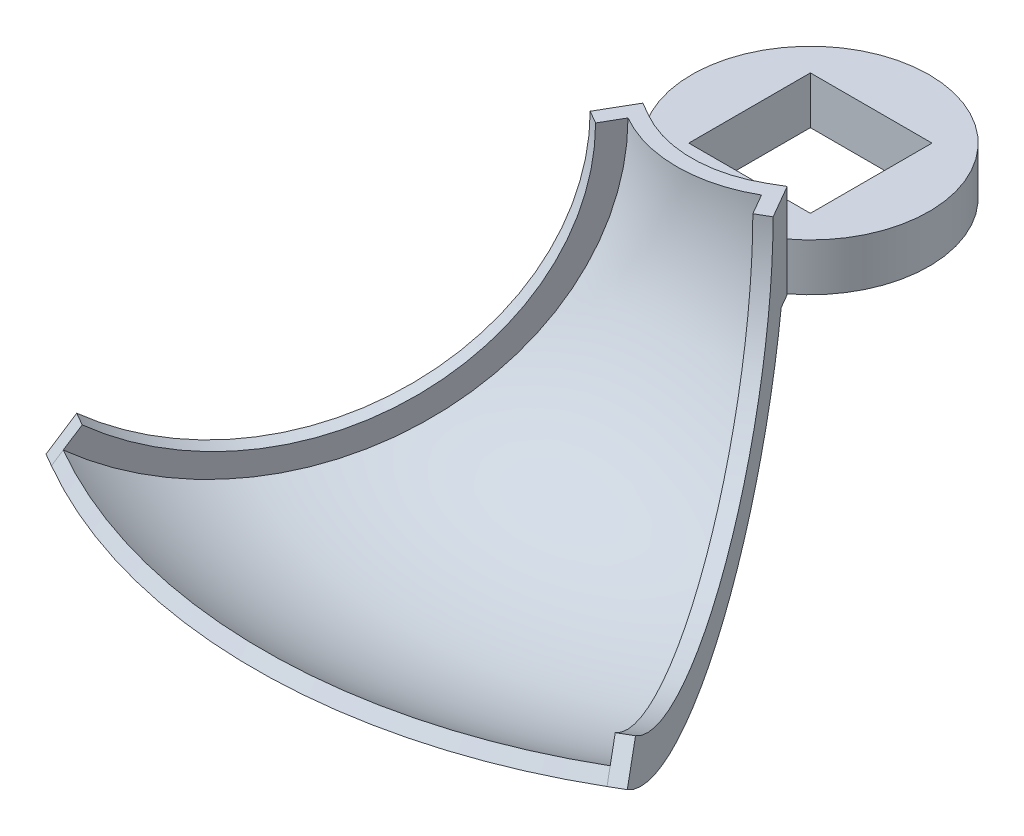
ISO-10303-21;
HEADER;
FILE_DESCRIPTION(('STEP AP214'),'2;1');
FILE_NAME('part.step','',(''),(''),'','','');
FILE_SCHEMA(('AUTOMOTIVE_DESIGN { 1 0 10303 214 1 1 1 1 }'));
ENDSEC;
DATA;
#1=APPLICATION_CONTEXT('core data for automotive mechanical design processes');
#2=APPLICATION_PROTOCOL_DEFINITION('international standard','automotive_design',2000,#1);
#3=PRODUCT_CONTEXT('',#1,'mechanical');
#4=PRODUCT('Part','Part','',(#3));
#5=PRODUCT_RELATED_PRODUCT_CATEGORY('part','',(#4));
#6=PRODUCT_DEFINITION_FORMATION('','',#4);
#7=PRODUCT_DEFINITION_CONTEXT('part definition',#1,'design');
#8=PRODUCT_DEFINITION('design','',#6,#7);
#9=PRODUCT_DEFINITION_SHAPE('','',#8);
#10=(LENGTH_UNIT() NAMED_UNIT(*) SI_UNIT(.MILLI.,.METRE.));
#11=(NAMED_UNIT(*) PLANE_ANGLE_UNIT() SI_UNIT($,.RADIAN.));
#12=(NAMED_UNIT(*) SI_UNIT($,.STERADIAN.) SOLID_ANGLE_UNIT());
#13=UNCERTAINTY_MEASURE_WITH_UNIT(LENGTH_MEASURE(1.E-05),#10,'distance_accuracy_value','');
#14=(GEOMETRIC_REPRESENTATION_CONTEXT(3) GLOBAL_UNCERTAINTY_ASSIGNED_CONTEXT((#13)) GLOBAL_UNIT_ASSIGNED_CONTEXT((#10,
#11,#12)) REPRESENTATION_CONTEXT('',''));
#15=CARTESIAN_POINT('',(0.,0.,0.));
#16=DIRECTION('',(0.,0.,1.));
#17=DIRECTION('',(1.,0.,0.));
#18=AXIS2_PLACEMENT_3D('',#15,#16,#17);
#19=CARTESIAN_POINT('',(0.,16.,0.));
#20=DIRECTION('',(0.,-1.,0.));
#21=DIRECTION('',(0.,0.,-1.));
#22=AXIS2_PLACEMENT_3D('',#19,#20,#21);
#23=CYLINDRICAL_SURFACE('',#22,40.);
#24=DIRECTION('',(0.,-1.,0.));
#25=VECTOR('',#24,1.);
#26=CARTESIAN_POINT('',(20.,0.,34.6410161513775));
#27=LINE('',#26,#25);
#28=CARTESIAN_POINT('',(20.,16.,34.6410161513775));
#29=VERTEX_POINT('',#28);
#30=CARTESIAN_POINT('',(20.,0.,34.6410161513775));
#31=VERTEX_POINT('',#30);
#32=EDGE_CURVE('E236',#29,#31,#27,.T.);
#33=ORIENTED_EDGE('',*,*,#32,.T.);
#34=CARTESIAN_POINT('',(0.,0.,0.));
#35=DIRECTION('',(0.,1.,0.));
#36=DIRECTION('',(0.,0.,1.));
#37=AXIS2_PLACEMENT_3D('',#34,#35,#36);
#38=CIRCLE('',#37,40.);
#39=CARTESIAN_POINT('',(-20.,0.,34.6410161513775));
#40=VERTEX_POINT('',#39);
#41=EDGE_CURVE('E40',#31,#40,#38,.T.);
#42=ORIENTED_EDGE('',*,*,#41,.T.);
#43=DIRECTION('',(0.,-1.,0.));
#44=VECTOR('',#43,1.);
#45=CARTESIAN_POINT('',(-20.,0.,34.6410161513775));
#46=LINE('',#45,#44);
#47=CARTESIAN_POINT('',(-20.,16.,34.6410161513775));
#48=VERTEX_POINT('',#47);
#49=EDGE_CURVE('E277',#48,#40,#46,.T.);
#50=ORIENTED_EDGE('',*,*,#49,.F.);
#51=CARTESIAN_POINT('',(0.,16.,0.));
#52=DIRECTION('',(0.,1.,0.));
#53=DIRECTION('',(0.,0.,1.));
#54=AXIS2_PLACEMENT_3D('',#51,#52,#53);
#55=CIRCLE('',#54,40.);
#56=EDGE_CURVE('E11',#29,#48,#55,.T.);
#57=ORIENTED_EDGE('',*,*,#56,.F.);
#58=EDGE_LOOP('',(#33,#42,#50,#57));
#59=FACE_BOUND('',#58,.T.);
#60=ADVANCED_FACE('F32',(#59),#23,.T.);
#61=CARTESIAN_POINT('',(0.,16.,0.));
#62=DIRECTION('',(0.,1.,0.));
#63=DIRECTION('',(0.,0.,1.));
#64=AXIS2_PLACEMENT_3D('',#61,#62,#63);
#65=PLANE('',#64);
#66=DIRECTION('',(0.,0.,-1.));
#67=VECTOR('',#66,1.);
#68=CARTESIAN_POINT('',(20.5,16.,20.5));
#69=LINE('',#68,#67);
#70=CARTESIAN_POINT('',(20.5,16.,20.5));
#71=VERTEX_POINT('',#70);
#72=CARTESIAN_POINT('',(20.5,16.,-20.5));
#73=VERTEX_POINT('',#72);
#74=EDGE_CURVE('E48',#71,#73,#69,.T.);
#75=ORIENTED_EDGE('',*,*,#74,.F.);
#76=DIRECTION('',(1.,0.,0.));
#77=VECTOR('',#76,1.);
#78=CARTESIAN_POINT('',(20.5,16.,20.5));
#79=LINE('',#78,#77);
#80=CARTESIAN_POINT('',(-20.5,16.,20.5));
#81=VERTEX_POINT('',#80);
#82=EDGE_CURVE('E267',#81,#71,#79,.T.);
#83=ORIENTED_EDGE('',*,*,#82,.F.);
#84=DIRECTION('',(0.,0.,1.));
#85=VECTOR('',#84,1.);
#86=CARTESIAN_POINT('',(-20.5,16.,20.5));
#87=LINE('',#86,#85);
#88=CARTESIAN_POINT('',(-20.5,16.,-20.5));
#89=VERTEX_POINT('',#88);
#90=EDGE_CURVE('E280',#89,#81,#87,.T.);
#91=ORIENTED_EDGE('',*,*,#90,.F.);
#92=DIRECTION('',(-1.,0.,0.));
#93=VECTOR('',#92,1.);
#94=CARTESIAN_POINT('',(20.5,16.,-20.5));
#95=LINE('',#94,#93);
#96=EDGE_CURVE('E276',#73,#89,#95,.T.);
#97=ORIENTED_EDGE('',*,*,#96,.F.);
#98=EDGE_LOOP('',(#75,#83,#91,#97));
#99=FACE_BOUND('',#98,.T.);
#100=ORIENTED_EDGE('',*,*,#56,.T.);
#101=CARTESIAN_POINT('',(0.,16.,0.));
#102=DIRECTION('',(0.,-1.,0.));
#103=DIRECTION('',(0.500000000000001,0.,0.866025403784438));
#104=AXIS2_PLACEMENT_3D('',#101,#102,#103);
#105=CIRCLE('',#104,40.);
#106=EDGE_CURVE('E242',#29,#48,#105,.T.);
#107=ORIENTED_EDGE('',*,*,#106,.F.);
#108=EDGE_LOOP('',(#100,#107));
#109=FACE_BOUND('',#108,.T.);
#110=ADVANCED_FACE('F397',(#99,#109),#65,.T.);
#111=CARTESIAN_POINT('',(0.,0.,0.));
#112=DIRECTION('',(0.,1.,0.));
#113=DIRECTION('',(0.,0.,1.));
#114=AXIS2_PLACEMENT_3D('',#111,#112,#113);
#115=PLANE('',#114);
#116=DIRECTION('',(1.,0.,0.));
#117=VECTOR('',#116,1.);
#118=CARTESIAN_POINT('',(20.5,0.,20.5));
#119=LINE('',#118,#117);
#120=CARTESIAN_POINT('',(-20.5,0.,20.5));
#121=VERTEX_POINT('',#120);
#122=CARTESIAN_POINT('',(20.5,0.,20.5));
#123=VERTEX_POINT('',#122);
#124=EDGE_CURVE('E271',#121,#123,#119,.T.);
#125=ORIENTED_EDGE('',*,*,#124,.T.);
#126=DIRECTION('',(0.,0.,-1.));
#127=VECTOR('',#126,1.);
#128=CARTESIAN_POINT('',(20.5,0.,20.5));
#129=LINE('',#128,#127);
#130=CARTESIAN_POINT('',(20.5,0.,-20.5));
#131=VERTEX_POINT('',#130);
#132=EDGE_CURVE('E263',#123,#131,#129,.T.);
#133=ORIENTED_EDGE('',*,*,#132,.T.);
#134=DIRECTION('',(-1.,0.,0.));
#135=VECTOR('',#134,1.);
#136=CARTESIAN_POINT('',(20.5,0.,-20.5));
#137=LINE('',#136,#135);
#138=CARTESIAN_POINT('',(-20.5,0.,-20.5));
#139=VERTEX_POINT('',#138);
#140=EDGE_CURVE('E266',#131,#139,#137,.T.);
#141=ORIENTED_EDGE('',*,*,#140,.T.);
#142=DIRECTION('',(0.,0.,1.));
#143=VECTOR('',#142,1.);
#144=CARTESIAN_POINT('',(-20.5,0.,20.5));
#145=LINE('',#144,#143);
#146=EDGE_CURVE('E56',#139,#121,#145,.T.);
#147=ORIENTED_EDGE('',*,*,#146,.T.);
#148=EDGE_LOOP('',(#125,#133,#141,#147));
#149=FACE_BOUND('',#148,.T.);
#150=ORIENTED_EDGE('',*,*,#41,.F.);
#151=DIRECTION('',(-0.866025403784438,0.,0.500000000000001));
#152=VECTOR('',#151,1.);
#153=CARTESIAN_POINT('',(24.3301270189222,0.,32.1410161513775));
#154=LINE('',#153,#152);
#155=CARTESIAN_POINT('',(24.3301270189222,0.,32.1410161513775));
#156=VERTEX_POINT('',#155);
#157=EDGE_CURVE('E211',#156,#31,#154,.T.);
#158=ORIENTED_EDGE('',*,*,#157,.F.);
#159=DIRECTION('',(-0.500000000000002,0.,-0.866025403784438));
#160=VECTOR('',#159,1.);
#161=CARTESIAN_POINT('',(27.0940017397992,0.,36.9281875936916));
#162=LINE('',#161,#160);
#163=CARTESIAN_POINT('',(27.0940017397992,0.,36.9281875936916));
#164=VERTEX_POINT('',#163);
#165=EDGE_CURVE('E210',#164,#156,#162,.T.);
#166=ORIENTED_EDGE('',*,*,#165,.F.);
#167=DIRECTION('',(-0.866025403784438,0.,0.500000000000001));
#168=VECTOR('',#167,1.);
#169=CARTESIAN_POINT('',(27.0940017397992,0.,36.9281875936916));
#170=LINE('',#169,#168);
#171=CARTESIAN_POINT('',(22.763874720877,0.,39.4281875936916));
#172=VERTEX_POINT('',#171);
#173=EDGE_CURVE('E217',#164,#172,#170,.T.);
#174=ORIENTED_EDGE('',*,*,#173,.T.);
#175=CARTESIAN_POINT('',(0.,0.,0.));
#176=DIRECTION('',(0.,-1.,0.));
#177=DIRECTION('',(0.500000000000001,0.,0.866025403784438));
#178=AXIS2_PLACEMENT_3D('',#175,#176,#177);
#179=CIRCLE('',#178,45.5277494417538);
#180=CARTESIAN_POINT('',(-22.763874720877,0.,39.4281875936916));
#181=VERTEX_POINT('',#180);
#182=EDGE_CURVE('E232',#172,#181,#179,.T.);
#183=ORIENTED_EDGE('',*,*,#182,.T.);
#184=DIRECTION('',(0.866025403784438,0.,0.500000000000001));
#185=VECTOR('',#184,1.);
#186=CARTESIAN_POINT('',(-27.0940017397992,0.,36.9281875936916));
#187=LINE('',#186,#185);
#188=CARTESIAN_POINT('',(-27.0940017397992,0.,36.9281875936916));
#189=VERTEX_POINT('',#188);
#190=EDGE_CURVE('E195',#189,#181,#187,.T.);
#191=ORIENTED_EDGE('',*,*,#190,.F.);
#192=DIRECTION('',(-0.500000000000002,0.,0.866025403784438));
#193=VECTOR('',#192,1.);
#194=CARTESIAN_POINT('',(-24.3301270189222,0.,32.1410161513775));
#195=LINE('',#194,#193);
#196=CARTESIAN_POINT('',(-24.3301270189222,0.,32.1410161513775));
#197=VERTEX_POINT('',#196);
#198=EDGE_CURVE('E174',#197,#189,#195,.T.);
#199=ORIENTED_EDGE('',*,*,#198,.F.);
#200=DIRECTION('',(0.866025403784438,0.,0.500000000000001));
#201=VECTOR('',#200,1.);
#202=CARTESIAN_POINT('',(-24.3301270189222,0.,32.1410161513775));
#203=LINE('',#202,#201);
#204=EDGE_CURVE('E171',#197,#40,#203,.T.);
#205=ORIENTED_EDGE('',*,*,#204,.T.);
#206=EDGE_LOOP('',(#150,#158,#166,#174,#183,#191,#199,#205));
#207=FACE_BOUND('',#206,.T.);
#208=ADVANCED_FACE('F328',(#149,#207),#115,.F.);
#209=CARTESIAN_POINT('',(20.5,0.,20.5));
#210=DIRECTION('',(1.,0.,0.));
#211=DIRECTION('',(0.,0.,-1.));
#212=AXIS2_PLACEMENT_3D('',#209,#210,#211);
#213=PLANE('',#212);
#214=ORIENTED_EDGE('',*,*,#74,.T.);
#215=DIRECTION('',(0.,1.,0.));
#216=VECTOR('',#215,1.);
#217=CARTESIAN_POINT('',(20.5,0.,-20.5));
#218=LINE('',#217,#216);
#219=EDGE_CURVE('E274',#131,#73,#218,.T.);
#220=ORIENTED_EDGE('',*,*,#219,.F.);
#221=ORIENTED_EDGE('',*,*,#132,.F.);
#222=DIRECTION('',(0.,1.,0.));
#223=VECTOR('',#222,1.);
#224=CARTESIAN_POINT('',(20.5,0.,20.5));
#225=LINE('',#224,#223);
#226=EDGE_CURVE('E285',#123,#71,#225,.T.);
#227=ORIENTED_EDGE('',*,*,#226,.T.);
#228=EDGE_LOOP('',(#214,#220,#221,#227));
#229=FACE_BOUND('',#228,.T.);
#230=ADVANCED_FACE('F405',(#229),#213,.F.);
#231=CARTESIAN_POINT('',(20.5,0.,20.5));
#232=DIRECTION('',(0.,0.,1.));
#233=DIRECTION('',(1.,0.,0.));
#234=AXIS2_PLACEMENT_3D('',#231,#232,#233);
#235=PLANE('',#234);
#236=ORIENTED_EDGE('',*,*,#82,.T.);
#237=ORIENTED_EDGE('',*,*,#226,.F.);
#238=ORIENTED_EDGE('',*,*,#124,.F.);
#239=DIRECTION('',(0.,1.,0.));
#240=VECTOR('',#239,1.);
#241=CARTESIAN_POINT('',(-20.5,0.,20.5));
#242=LINE('',#241,#240);
#243=EDGE_CURVE('E287',#121,#81,#242,.T.);
#244=ORIENTED_EDGE('',*,*,#243,.T.);
#245=EDGE_LOOP('',(#236,#237,#238,#244));
#246=FACE_BOUND('',#245,.T.);
#247=ADVANCED_FACE('F410',(#246),#235,.F.);
#248=CARTESIAN_POINT('',(-20.5,0.,20.5));
#249=DIRECTION('',(-1.,0.,0.));
#250=DIRECTION('',(0.,0.,1.));
#251=AXIS2_PLACEMENT_3D('',#248,#249,#250);
#252=PLANE('',#251);
#253=ORIENTED_EDGE('',*,*,#90,.T.);
#254=ORIENTED_EDGE('',*,*,#243,.F.);
#255=ORIENTED_EDGE('',*,*,#146,.F.);
#256=DIRECTION('',(0.,1.,0.));
#257=VECTOR('',#256,1.);
#258=CARTESIAN_POINT('',(-20.5,0.,-20.5));
#259=LINE('',#258,#257);
#260=EDGE_CURVE('E289',#139,#89,#259,.T.);
#261=ORIENTED_EDGE('',*,*,#260,.T.);
#262=EDGE_LOOP('',(#253,#254,#255,#261));
#263=FACE_BOUND('',#262,.T.);
#264=ADVANCED_FACE('F415',(#263),#252,.F.);
#265=CARTESIAN_POINT('',(20.5,0.,-20.5));
#266=DIRECTION('',(0.,0.,-1.));
#267=DIRECTION('',(-1.,0.,0.));
#268=AXIS2_PLACEMENT_3D('',#265,#266,#267);
#269=PLANE('',#268);
#270=ORIENTED_EDGE('',*,*,#96,.T.);
#271=ORIENTED_EDGE('',*,*,#260,.F.);
#272=ORIENTED_EDGE('',*,*,#140,.F.);
#273=ORIENTED_EDGE('',*,*,#219,.T.);
#274=EDGE_LOOP('',(#270,#271,#272,#273));
#275=FACE_BOUND('',#274,.T.);
#276=ADVANCED_FACE('F411',(#275),#269,.F.);
#277=CARTESIAN_POINT('',(0.,31.5848916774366,0.));
#278=DIRECTION('',(0.,-1.,0.));
#279=DIRECTION('',(0.,0.,-1.));
#280=AXIS2_PLACEMENT_3D('',#277,#278,#279);
#281=TOROIDAL_SURFACE('',#280,133.,93.);
#282=CARTESIAN_POINT('',(0.,-43.926448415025,0.));
#283=DIRECTION('',(0.,-1.,0.));
#284=DIRECTION('',(0.500000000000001,0.,0.866025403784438));
#285=AXIS2_PLACEMENT_3D('',#282,#283,#284);
#286=CIRCLE('',#285,187.286623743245);
#287=CARTESIAN_POINT('',(93.6433118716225,-43.926448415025,162.194973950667));
#288=VERTEX_POINT('',#287);
#289=CARTESIAN_POINT('',(-93.6433118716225,-43.926448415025,162.194973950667));
#290=VERTEX_POINT('',#289);
#291=EDGE_CURVE('E235',#288,#290,#286,.T.);
#292=ORIENTED_EDGE('',*,*,#291,.T.);
#293=CARTESIAN_POINT('',(-66.5000000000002,31.5848916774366,115.18137870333));
#294=DIRECTION('',(-0.866025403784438,0.,-0.500000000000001));
#295=DIRECTION('',(-0.500000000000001,0.,0.866025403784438));
#296=AXIS2_PLACEMENT_3D('',#293,#294,#295);
#297=CIRCLE('',#296,93.);
#298=EDGE_CURVE('E239',#181,#290,#297,.T.);
#299=ORIENTED_EDGE('',*,*,#298,.F.);
#300=ORIENTED_EDGE('',*,*,#182,.F.);
#301=CARTESIAN_POINT('',(66.5000000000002,31.5848916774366,115.18137870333));
#302=DIRECTION('',(-0.866025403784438,0.,0.500000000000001));
#303=DIRECTION('',(0.500000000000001,0.,0.866025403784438));
#304=AXIS2_PLACEMENT_3D('',#301,#302,#303);
#305=CIRCLE('',#304,93.);
#306=EDGE_CURVE('E231',#172,#288,#305,.T.);
#307=ORIENTED_EDGE('',*,*,#306,.T.);
#308=EDGE_LOOP('',(#292,#299,#300,#307));
#309=FACE_BOUND('',#308,.T.);
#310=ADVANCED_FACE('F414',(#309),#281,.T.);
#311=CARTESIAN_POINT('',(0.,-43.926448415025,0.));
#312=DIRECTION('',(0.,-1.,0.));
#313=DIRECTION('',(0.,0.,-1.));
#314=AXIS2_PLACEMENT_3D('',#311,#312,#313);
#315=CONICAL_SURFACE('',#314,187.286623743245,0.623311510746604);
#316=CARTESIAN_POINT('',(0.,-39.8666989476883,0.));
#317=DIRECTION('',(0.,-1.,0.));
#318=DIRECTION('',(0.500000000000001,0.,0.866025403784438));
#319=AXIS2_PLACEMENT_3D('',#316,#317,#318);
#320=CIRCLE('',#319,184.367988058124);
#321=CARTESIAN_POINT('',(92.1839940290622,-39.8666989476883,159.667361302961));
#322=VERTEX_POINT('',#321);
#323=CARTESIAN_POINT('',(-92.1839940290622,-39.8666989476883,159.667361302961));
#324=VERTEX_POINT('',#323);
#325=EDGE_CURVE('E245',#322,#324,#320,.T.);
#326=ORIENTED_EDGE('',*,*,#325,.T.);
#327=DIRECTION('',(0.291863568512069,0.811949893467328,-0.505522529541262));
#328=VECTOR('',#327,1.);
#329=CARTESIAN_POINT('',(-92.1839940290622,-39.8666989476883,159.667361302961));
#330=LINE('',#329,#328);
#331=EDGE_CURVE('E241',#290,#324,#330,.T.);
#332=ORIENTED_EDGE('',*,*,#331,.F.);
#333=ORIENTED_EDGE('',*,*,#291,.F.);
#334=DIRECTION('',(-0.291863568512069,0.811949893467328,-0.505522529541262));
#335=VECTOR('',#334,1.);
#336=CARTESIAN_POINT('',(92.1839940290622,-39.8666989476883,159.667361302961));
#337=LINE('',#336,#335);
#338=EDGE_CURVE('E238',#288,#322,#337,.T.);
#339=ORIENTED_EDGE('',*,*,#338,.T.);
#340=EDGE_LOOP('',(#326,#332,#333,#339));
#341=FACE_BOUND('',#340,.T.);
#342=ADVANCED_FACE('F371',(#341),#315,.T.);
#343=CARTESIAN_POINT('',(0.,31.5848916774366,0.));
#344=DIRECTION('',(0.,-1.,0.));
#345=DIRECTION('',(0.,0.,-1.));
#346=AXIS2_PLACEMENT_3D('',#343,#344,#345);
#347=TOROIDAL_SURFACE('',#346,133.,88.);
#348=CARTESIAN_POINT('',(0.,31.5848916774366,0.));
#349=DIRECTION('',(0.,-1.,0.));
#350=DIRECTION('',(0.500000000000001,0.,0.866025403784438));
#351=AXIS2_PLACEMENT_3D('',#348,#349,#350);
#352=CIRCLE('',#351,45.);
#353=CARTESIAN_POINT('',(22.5000000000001,31.5848916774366,38.9711431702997));
#354=VERTEX_POINT('',#353);
#355=CARTESIAN_POINT('',(-22.5000000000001,31.5848916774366,38.9711431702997));
#356=VERTEX_POINT('',#355);
#357=EDGE_CURVE('E254',#354,#356,#352,.T.);
#358=ORIENTED_EDGE('',*,*,#357,.T.);
#359=CARTESIAN_POINT('',(-66.5000000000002,31.5848916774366,115.18137870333));
#360=DIRECTION('',(0.866025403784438,0.,0.500000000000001));
#361=DIRECTION('',(-0.500000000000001,0.,0.866025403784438));
#362=AXIS2_PLACEMENT_3D('',#359,#360,#361);
#363=CIRCLE('',#362,88.);
#364=EDGE_CURVE('E251',#324,#356,#363,.T.);
#365=ORIENTED_EDGE('',*,*,#364,.F.);
#366=ORIENTED_EDGE('',*,*,#325,.F.);
#367=CARTESIAN_POINT('',(66.5000000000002,31.5848916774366,115.18137870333));
#368=DIRECTION('',(0.866025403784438,0.,-0.500000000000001));
#369=DIRECTION('',(0.500000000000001,0.,0.866025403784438));
#370=AXIS2_PLACEMENT_3D('',#367,#368,#369);
#371=CIRCLE('',#370,88.);
#372=EDGE_CURVE('E248',#322,#354,#371,.T.);
#373=ORIENTED_EDGE('',*,*,#372,.T.);
#374=EDGE_LOOP('',(#358,#365,#366,#373));
#375=FACE_BOUND('',#374,.T.);
#376=ADVANCED_FACE('F369',(#375),#347,.F.);
#377=CARTESIAN_POINT('',(20.,31.5848916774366,34.6410161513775));
#378=DIRECTION('',(0.,1.,0.));
#379=DIRECTION('',(0.,0.,1.));
#380=AXIS2_PLACEMENT_3D('',#377,#378,#379);
#381=PLANE('',#380);
#382=CARTESIAN_POINT('',(0.,31.5848916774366,0.));
#383=DIRECTION('',(0.,-1.,0.));
#384=DIRECTION('',(0.500000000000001,0.,0.866025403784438));
#385=AXIS2_PLACEMENT_3D('',#382,#383,#384);
#386=CIRCLE('',#385,40.);
#387=CARTESIAN_POINT('',(20.,31.5848916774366,34.6410161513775));
#388=VERTEX_POINT('',#387);
#389=CARTESIAN_POINT('',(-20.,31.5848916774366,34.6410161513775));
#390=VERTEX_POINT('',#389);
#391=EDGE_CURVE('E190',#388,#390,#386,.T.);
#392=ORIENTED_EDGE('',*,*,#391,.T.);
#393=DIRECTION('',(0.866025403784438,0.,0.500000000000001));
#394=VECTOR('',#393,1.);
#395=CARTESIAN_POINT('',(-24.3301270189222,31.5848916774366,32.1410161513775));
#396=LINE('',#395,#394);
#397=CARTESIAN_POINT('',(-24.3301270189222,31.5848916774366,32.1410161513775));
#398=VERTEX_POINT('',#397);
#399=EDGE_CURVE('E168',#398,#390,#396,.T.);
#400=ORIENTED_EDGE('',*,*,#399,.F.);
#401=DIRECTION('',(0.500000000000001,0.,-0.866025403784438));
#402=VECTOR('',#401,1.);
#403=CARTESIAN_POINT('',(-26.8301270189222,31.5848916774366,36.4711431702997));
#404=LINE('',#403,#402);
#405=CARTESIAN_POINT('',(-30.8301270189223,31.5848916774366,43.3993464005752));
#406=VERTEX_POINT('',#405);
#407=EDGE_CURVE('E175',#406,#398,#404,.T.);
#408=ORIENTED_EDGE('',*,*,#407,.F.);
#409=DIRECTION('',(0.866025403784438,0.,0.500000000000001));
#410=VECTOR('',#409,1.);
#411=CARTESIAN_POINT('',(-30.8301270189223,31.5848916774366,43.3993464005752));
#412=LINE('',#411,#410);
#413=CARTESIAN_POINT('',(-26.5000000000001,31.5848916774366,45.8993464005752));
#414=VERTEX_POINT('',#413);
#415=EDGE_CURVE('E339',#406,#414,#412,.T.);
#416=ORIENTED_EDGE('',*,*,#415,.T.);
#417=DIRECTION('',(0.500000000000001,0.,-0.866025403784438));
#418=VECTOR('',#417,1.);
#419=CARTESIAN_POINT('',(-22.5,31.5848916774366,38.9711431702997));
#420=LINE('',#419,#418);
#421=EDGE_CURVE('E184',#414,#356,#420,.T.);
#422=ORIENTED_EDGE('',*,*,#421,.T.);
#423=ORIENTED_EDGE('',*,*,#357,.F.);
#424=DIRECTION('',(0.500000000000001,0.,0.866025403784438));
#425=VECTOR('',#424,1.);
#426=CARTESIAN_POINT('',(22.5000000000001,31.5848916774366,38.9711431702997));
#427=LINE('',#426,#425);
#428=CARTESIAN_POINT('',(26.5000000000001,31.5848916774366,45.8993464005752));
#429=VERTEX_POINT('',#428);
#430=EDGE_CURVE('E191',#354,#429,#427,.T.);
#431=ORIENTED_EDGE('',*,*,#430,.T.);
#432=DIRECTION('',(-0.866025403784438,0.,0.500000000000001));
#433=VECTOR('',#432,1.);
#434=CARTESIAN_POINT('',(30.8301270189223,31.5848916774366,43.3993464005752));
#435=LINE('',#434,#433);
#436=CARTESIAN_POINT('',(30.8301270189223,31.5848916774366,43.3993464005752));
#437=VERTEX_POINT('',#436);
#438=EDGE_CURVE('E226',#437,#429,#435,.T.);
#439=ORIENTED_EDGE('',*,*,#438,.F.);
#440=DIRECTION('',(0.500000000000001,0.,0.866025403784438));
#441=VECTOR('',#440,1.);
#442=CARTESIAN_POINT('',(24.3301270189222,31.5848916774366,32.1410161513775));
#443=LINE('',#442,#441);
#444=CARTESIAN_POINT('',(24.3301270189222,31.5848916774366,32.1410161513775));
#445=VERTEX_POINT('',#444);
#446=EDGE_CURVE('E201',#445,#437,#443,.T.);
#447=ORIENTED_EDGE('',*,*,#446,.F.);
#448=DIRECTION('',(-0.866025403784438,0.,0.500000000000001));
#449=VECTOR('',#448,1.);
#450=CARTESIAN_POINT('',(24.3301270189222,31.5848916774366,32.1410161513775));
#451=LINE('',#450,#449);
#452=EDGE_CURVE('E229',#445,#388,#451,.T.);
#453=ORIENTED_EDGE('',*,*,#452,.T.);
#454=EDGE_LOOP('',(#392,#400,#408,#416,#422,#423,#431,#439,#447,#453));
#455=FACE_BOUND('',#454,.T.);
#456=ADVANCED_FACE('F187',(#455),#381,.T.);
#457=CARTESIAN_POINT('',(0.,16.,0.));
#458=DIRECTION('',(0.,-1.,0.));
#459=DIRECTION('',(0.,0.,-1.));
#460=AXIS2_PLACEMENT_3D('',#457,#458,#459);
#461=CYLINDRICAL_SURFACE('',#460,40.);
#462=ORIENTED_EDGE('',*,*,#106,.T.);
#463=DIRECTION('',(0.,-1.,0.));
#464=VECTOR('',#463,1.);
#465=CARTESIAN_POINT('',(-20.,16.,34.6410161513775));
#466=LINE('',#465,#464);
#467=EDGE_CURVE('E260',#390,#48,#466,.T.);
#468=ORIENTED_EDGE('',*,*,#467,.F.);
#469=ORIENTED_EDGE('',*,*,#391,.F.);
#470=DIRECTION('',(0.,-1.,0.));
#471=VECTOR('',#470,1.);
#472=CARTESIAN_POINT('',(20.,16.,34.6410161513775));
#473=LINE('',#472,#471);
#474=EDGE_CURVE('E257',#388,#29,#473,.T.);
#475=ORIENTED_EDGE('',*,*,#474,.T.);
#476=EDGE_LOOP('',(#462,#468,#469,#475));
#477=FACE_BOUND('',#476,.T.);
#478=ADVANCED_FACE('F395',(#477),#461,.F.);
#479=CARTESIAN_POINT('',(24.3301270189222,16.,32.1410161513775));
#480=DIRECTION('',(0.500000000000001,0.,0.866025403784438));
#481=DIRECTION('',(0.866025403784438,0.,-0.500000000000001));
#482=AXIS2_PLACEMENT_3D('',#479,#480,#481);
#483=PLANE('',#482);
#484=ORIENTED_EDGE('',*,*,#32,.F.);
#485=ORIENTED_EDGE('',*,*,#474,.F.);
#486=ORIENTED_EDGE('',*,*,#452,.F.);
#487=DIRECTION('',(0.,1.,0.));
#488=VECTOR('',#487,1.);
#489=CARTESIAN_POINT('',(24.3301270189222,0.,32.1410161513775));
#490=LINE('',#489,#488);
#491=EDGE_CURVE('E199',#156,#445,#490,.T.);
#492=ORIENTED_EDGE('',*,*,#491,.F.);
#493=ORIENTED_EDGE('',*,*,#157,.T.);
#494=EDGE_LOOP('',(#484,#485,#486,#492,#493));
#495=FACE_BOUND('',#494,.T.);
#496=ADVANCED_FACE('F320',(#495),#483,.F.);
#497=CARTESIAN_POINT('',(70.8301270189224,31.5848916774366,112.68137870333));
#498=DIRECTION('',(-0.866025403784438,0.,0.500000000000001));
#499=DIRECTION('',(0.500000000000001,0.,0.866025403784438));
#500=AXIS2_PLACEMENT_3D('',#497,#498,#499);
#501=CYLINDRICAL_SURFACE('',#500,80.);
#502=CARTESIAN_POINT('',(66.5000000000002,31.5848916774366,115.18137870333));
#503=DIRECTION('',(-0.866025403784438,0.,0.500000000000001));
#504=DIRECTION('',(-0.500000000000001,0.,-0.866025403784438));
#505=AXIS2_PLACEMENT_3D('',#502,#503,#504);
#506=CIRCLE('',#505,80.);
#507=CARTESIAN_POINT('',(89.8490854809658,-33.3710997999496,155.623181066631));
#508=VERTEX_POINT('',#507);
#509=EDGE_CURVE('E193',#429,#508,#506,.T.);
#510=ORIENTED_EDGE('',*,*,#509,.T.);
#511=DIRECTION('',(-0.866025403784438,0.,0.500000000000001));
#512=VECTOR('',#511,1.);
#513=CARTESIAN_POINT('',(94.179212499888,-33.3710997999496,153.123181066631));
#514=LINE('',#513,#512);
#515=CARTESIAN_POINT('',(94.179212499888,-33.3710997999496,153.123181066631));
#516=VERTEX_POINT('',#515);
#517=EDGE_CURVE('E223',#516,#508,#514,.T.);
#518=ORIENTED_EDGE('',*,*,#517,.F.);
#519=CARTESIAN_POINT('',(70.8301270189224,31.5848916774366,112.68137870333));
#520=DIRECTION('',(-0.866025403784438,0.,0.500000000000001));
#521=DIRECTION('',(-0.500000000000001,0.,-0.866025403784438));
#522=AXIS2_PLACEMENT_3D('',#519,#520,#521);
#523=CIRCLE('',#522,80.);
#524=EDGE_CURVE('E204',#437,#516,#523,.T.);
#525=ORIENTED_EDGE('',*,*,#524,.F.);
#526=ORIENTED_EDGE('',*,*,#438,.T.);
#527=EDGE_LOOP('',(#510,#518,#525,#526));
#528=FACE_BOUND('',#527,.T.);
#529=ADVANCED_FACE('F387',(#528),#501,.F.);
#530=CARTESIAN_POINT('',(96.5141210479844,-39.8666989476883,157.167361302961));
#531=DIRECTION('',(-0.405974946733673,-0.583727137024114,-0.703169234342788));
#532=DIRECTION('',(0.,0.769429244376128,-0.6387320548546));
#533=AXIS2_PLACEMENT_3D('',#530,#531,#532);
#534=PLANE('',#533);
#535=DIRECTION('',(0.291863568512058,-0.811949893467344,0.505522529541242));
#536=VECTOR('',#535,1.);
#537=CARTESIAN_POINT('',(92.1839940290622,-39.8666989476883,159.667361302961));
#538=LINE('',#537,#536);
#539=EDGE_CURVE('E202',#508,#322,#538,.T.);
#540=ORIENTED_EDGE('',*,*,#539,.T.);
#541=ORIENTED_EDGE('',*,*,#338,.F.);
#542=DIRECTION('',(-0.866025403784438,0.,0.500000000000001));
#543=VECTOR('',#542,1.);
#544=CARTESIAN_POINT('',(97.9734388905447,-43.926448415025,159.694973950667));
#545=LINE('',#544,#543);
#546=CARTESIAN_POINT('',(97.9734388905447,-43.926448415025,159.694973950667));
#547=VERTEX_POINT('',#546);
#548=EDGE_CURVE('E220',#547,#288,#545,.T.);
#549=ORIENTED_EDGE('',*,*,#548,.F.);
#550=DIRECTION('',(0.291863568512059,-0.811949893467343,0.505522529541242));
#551=VECTOR('',#550,1.);
#552=CARTESIAN_POINT('',(96.5141210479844,-39.8666989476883,157.167361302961));
#553=LINE('',#552,#551);
#554=EDGE_CURVE('E206',#516,#547,#553,.T.);
#555=ORIENTED_EDGE('',*,*,#554,.F.);
#556=ORIENTED_EDGE('',*,*,#517,.T.);
#557=EDGE_LOOP('',(#540,#541,#549,#555,#556));
#558=FACE_BOUND('',#557,.T.);
#559=ADVANCED_FACE('F376',(#558),#534,.F.);
#560=CARTESIAN_POINT('',(70.8301270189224,31.5848916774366,112.68137870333));
#561=DIRECTION('',(-0.866025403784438,0.,0.500000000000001));
#562=DIRECTION('',(0.500000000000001,0.,0.866025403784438));
#563=AXIS2_PLACEMENT_3D('',#560,#561,#562);
#564=CYLINDRICAL_SURFACE('',#563,93.);
#565=ORIENTED_EDGE('',*,*,#548,.T.);
#566=ORIENTED_EDGE('',*,*,#306,.F.);
#567=ORIENTED_EDGE('',*,*,#173,.F.);
#568=CARTESIAN_POINT('',(70.8301270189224,31.5848916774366,112.68137870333));
#569=DIRECTION('',(0.866025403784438,0.,-0.500000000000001));
#570=DIRECTION('',(-0.500000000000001,0.,-0.866025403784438));
#571=AXIS2_PLACEMENT_3D('',#568,#569,#570);
#572=CIRCLE('',#571,93.);
#573=EDGE_CURVE('E208',#547,#164,#572,.T.);
#574=ORIENTED_EDGE('',*,*,#573,.F.);
#575=EDGE_LOOP('',(#565,#566,#567,#574));
#576=FACE_BOUND('',#575,.T.);
#577=ADVANCED_FACE('F380',(#576),#564,.T.);
#578=CARTESIAN_POINT('',(70.8301270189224,31.5848916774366,112.68137870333));
#579=DIRECTION('',(0.866025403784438,0.,-0.500000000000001));
#580=DIRECTION('',(-0.500000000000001,0.,-0.866025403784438));
#581=AXIS2_PLACEMENT_3D('',#578,#579,#580);
#582=PLANE('',#581);
#583=ORIENTED_EDGE('',*,*,#491,.T.);
#584=ORIENTED_EDGE('',*,*,#446,.T.);
#585=ORIENTED_EDGE('',*,*,#524,.T.);
#586=ORIENTED_EDGE('',*,*,#554,.T.);
#587=ORIENTED_EDGE('',*,*,#573,.T.);
#588=ORIENTED_EDGE('',*,*,#165,.T.);
#589=EDGE_LOOP('',(#583,#584,#585,#586,#587,#588));
#590=FACE_BOUND('',#589,.T.);
#591=ADVANCED_FACE('F383',(#590),#582,.T.);
#592=CARTESIAN_POINT('',(66.5000000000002,31.5848916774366,115.18137870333));
#593=DIRECTION('',(0.866025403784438,0.,-0.500000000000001));
#594=DIRECTION('',(-0.500000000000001,0.,-0.866025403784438));
#595=AXIS2_PLACEMENT_3D('',#592,#593,#594);
#596=PLANE('',#595);
#597=ORIENTED_EDGE('',*,*,#372,.F.);
#598=ORIENTED_EDGE('',*,*,#539,.F.);
#599=ORIENTED_EDGE('',*,*,#509,.F.);
#600=ORIENTED_EDGE('',*,*,#430,.F.);
#601=EDGE_LOOP('',(#597,#598,#599,#600));
#602=FACE_BOUND('',#601,.T.);
#603=ADVANCED_FACE('F391',(#602),#596,.F.);
#604=CARTESIAN_POINT('',(-24.3301270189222,16.,32.1410161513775));
#605=DIRECTION('',(-0.500000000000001,0.,0.866025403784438));
#606=DIRECTION('',(0.866025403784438,0.,0.500000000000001));
#607=AXIS2_PLACEMENT_3D('',#604,#605,#606);
#608=PLANE('',#607);
#609=ORIENTED_EDGE('',*,*,#467,.T.);
#610=ORIENTED_EDGE('',*,*,#49,.T.);
#611=ORIENTED_EDGE('',*,*,#204,.F.);
#612=DIRECTION('',(0.,-1.,0.));
#613=VECTOR('',#612,1.);
#614=CARTESIAN_POINT('',(-24.3301270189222,31.5848916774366,32.1410161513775));
#615=LINE('',#614,#613);
#616=EDGE_CURVE('E163',#398,#197,#615,.T.);
#617=ORIENTED_EDGE('',*,*,#616,.F.);
#618=ORIENTED_EDGE('',*,*,#399,.T.);
#619=EDGE_LOOP('',(#609,#610,#611,#617,#618));
#620=FACE_BOUND('',#619,.T.);
#621=ADVANCED_FACE('F166',(#620),#608,.F.);
#622=CARTESIAN_POINT('',(-70.8301270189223,31.5848916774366,112.68137870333));
#623=DIRECTION('',(0.866025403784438,0.,0.500000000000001));
#624=DIRECTION('',(0.500000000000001,0.,-0.866025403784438));
#625=AXIS2_PLACEMENT_3D('',#622,#623,#624);
#626=CYLINDRICAL_SURFACE('',#625,93.);
#627=ORIENTED_EDGE('',*,*,#298,.T.);
#628=DIRECTION('',(0.866025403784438,0.,0.500000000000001));
#629=VECTOR('',#628,1.);
#630=CARTESIAN_POINT('',(-97.9734388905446,-43.9264484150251,159.694973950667));
#631=LINE('',#630,#629);
#632=CARTESIAN_POINT('',(-97.9734388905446,-43.9264484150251,159.694973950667));
#633=VERTEX_POINT('',#632);
#634=EDGE_CURVE('E349',#633,#290,#631,.T.);
#635=ORIENTED_EDGE('',*,*,#634,.F.);
#636=CARTESIAN_POINT('',(-70.8301270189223,31.5848916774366,112.68137870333));
#637=DIRECTION('',(-0.866025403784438,0.,-0.500000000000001));
#638=DIRECTION('',(-0.500000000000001,0.,0.866025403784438));
#639=AXIS2_PLACEMENT_3D('',#636,#637,#638);
#640=CIRCLE('',#639,93.);
#641=EDGE_CURVE('E332',#189,#633,#640,.T.);
#642=ORIENTED_EDGE('',*,*,#641,.F.);
#643=ORIENTED_EDGE('',*,*,#190,.T.);
#644=EDGE_LOOP('',(#627,#635,#642,#643));
#645=FACE_BOUND('',#644,.T.);
#646=ADVANCED_FACE('F355',(#645),#626,.T.);
#647=CARTESIAN_POINT('',(-96.5141210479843,-39.8666989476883,157.167361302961));
#648=DIRECTION('',(0.405974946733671,-0.583727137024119,-0.703169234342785));
#649=DIRECTION('',(0.,0.769429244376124,-0.638732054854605));
#650=AXIS2_PLACEMENT_3D('',#647,#648,#649);
#651=PLANE('',#650);
#652=ORIENTED_EDGE('',*,*,#331,.T.);
#653=DIRECTION('',(0.291863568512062,0.81194989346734,-0.505522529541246));
#654=VECTOR('',#653,1.);
#655=CARTESIAN_POINT('',(-92.1839940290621,-39.8666989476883,159.667361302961));
#656=LINE('',#655,#654);
#657=CARTESIAN_POINT('',(-89.8490854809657,-33.3710997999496,155.623181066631));
#658=VERTEX_POINT('',#657);
#659=EDGE_CURVE('E340',#324,#658,#656,.T.);
#660=ORIENTED_EDGE('',*,*,#659,.T.);
#661=DIRECTION('',(0.866025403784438,0.,0.500000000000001));
#662=VECTOR('',#661,1.);
#663=CARTESIAN_POINT('',(-94.1792124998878,-33.3710997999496,153.123181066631));
#664=LINE('',#663,#662);
#665=CARTESIAN_POINT('',(-94.1792124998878,-33.3710997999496,153.123181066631));
#666=VERTEX_POINT('',#665);
#667=EDGE_CURVE('E347',#666,#658,#664,.T.);
#668=ORIENTED_EDGE('',*,*,#667,.F.);
#669=DIRECTION('',(0.291863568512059,0.811949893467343,-0.505522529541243));
#670=VECTOR('',#669,1.);
#671=CARTESIAN_POINT('',(-97.9734388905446,-43.926448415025,159.694973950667));
#672=LINE('',#671,#670);
#673=EDGE_CURVE('E334',#633,#666,#672,.T.);
#674=ORIENTED_EDGE('',*,*,#673,.F.);
#675=ORIENTED_EDGE('',*,*,#634,.T.);
#676=EDGE_LOOP('',(#652,#660,#668,#674,#675));
#677=FACE_BOUND('',#676,.T.);
#678=ADVANCED_FACE('F358',(#677),#651,.F.);
#679=CARTESIAN_POINT('',(-70.8301270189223,31.5848916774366,112.68137870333));
#680=DIRECTION('',(0.866025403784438,0.,0.500000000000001));
#681=DIRECTION('',(0.500000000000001,0.,-0.866025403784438));
#682=AXIS2_PLACEMENT_3D('',#679,#680,#681);
#683=CYLINDRICAL_SURFACE('',#682,80.);
#684=CARTESIAN_POINT('',(-66.5000000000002,31.5848916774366,115.18137870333));
#685=DIRECTION('',(0.866025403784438,0.,0.500000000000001));
#686=DIRECTION('',(-0.500000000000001,0.,0.866025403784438));
#687=AXIS2_PLACEMENT_3D('',#684,#685,#686);
#688=CIRCLE('',#687,80.);
#689=EDGE_CURVE('E342',#658,#414,#688,.T.);
#690=ORIENTED_EDGE('',*,*,#689,.T.);
#691=ORIENTED_EDGE('',*,*,#415,.F.);
#692=CARTESIAN_POINT('',(-70.8301270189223,31.5848916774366,112.68137870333));
#693=DIRECTION('',(0.866025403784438,0.,0.500000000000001));
#694=DIRECTION('',(-0.500000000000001,0.,0.866025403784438));
#695=AXIS2_PLACEMENT_3D('',#692,#693,#694);
#696=CIRCLE('',#695,80.);
#697=EDGE_CURVE('E180',#666,#406,#696,.T.);
#698=ORIENTED_EDGE('',*,*,#697,.F.);
#699=ORIENTED_EDGE('',*,*,#667,.T.);
#700=EDGE_LOOP('',(#690,#691,#698,#699));
#701=FACE_BOUND('',#700,.T.);
#702=ADVANCED_FACE('F362',(#701),#683,.F.);
#703=CARTESIAN_POINT('',(-70.8301270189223,31.5848916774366,112.68137870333));
#704=DIRECTION('',(-0.866025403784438,0.,-0.500000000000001));
#705=DIRECTION('',(-0.500000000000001,0.,0.866025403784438));
#706=AXIS2_PLACEMENT_3D('',#703,#704,#705);
#707=PLANE('',#706);
#708=ORIENTED_EDGE('',*,*,#407,.T.);
#709=ORIENTED_EDGE('',*,*,#616,.T.);
#710=ORIENTED_EDGE('',*,*,#198,.T.);
#711=ORIENTED_EDGE('',*,*,#641,.T.);
#712=ORIENTED_EDGE('',*,*,#673,.T.);
#713=ORIENTED_EDGE('',*,*,#697,.T.);
#714=EDGE_LOOP('',(#708,#709,#710,#711,#712,#713));
#715=FACE_BOUND('',#714,.T.);
#716=ADVANCED_FACE('F178',(#715),#707,.T.);
#717=CARTESIAN_POINT('',(-66.5000000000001,31.5848916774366,115.18137870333));
#718=DIRECTION('',(-0.866025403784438,0.,-0.500000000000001));
#719=DIRECTION('',(-0.500000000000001,0.,0.866025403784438));
#720=AXIS2_PLACEMENT_3D('',#717,#718,#719);
#721=PLANE('',#720);
#722=ORIENTED_EDGE('',*,*,#364,.T.);
#723=ORIENTED_EDGE('',*,*,#421,.F.);
#724=ORIENTED_EDGE('',*,*,#689,.F.);
#725=ORIENTED_EDGE('',*,*,#659,.F.);
#726=EDGE_LOOP('',(#722,#723,#724,#725));
#727=FACE_BOUND('',#726,.T.);
#728=ADVANCED_FACE('F366',(#727),#721,.F.);
#729=CLOSED_SHELL('',(#60,#110,#208,#230,#247,#264,#276,#310,#342,#376,#456,#478,#496,#529,#559,
#577,#591,#603,#621,#646,#678,#702,#716,#728));
#730=MANIFOLD_SOLID_BREP('B2',#729);
#731=ADVANCED_BREP_SHAPE_REPRESENTATION('',(#18,#730),#14);
#732=SHAPE_DEFINITION_REPRESENTATION(#9,#731);
ENDSEC;
END-ISO-10303-21;
